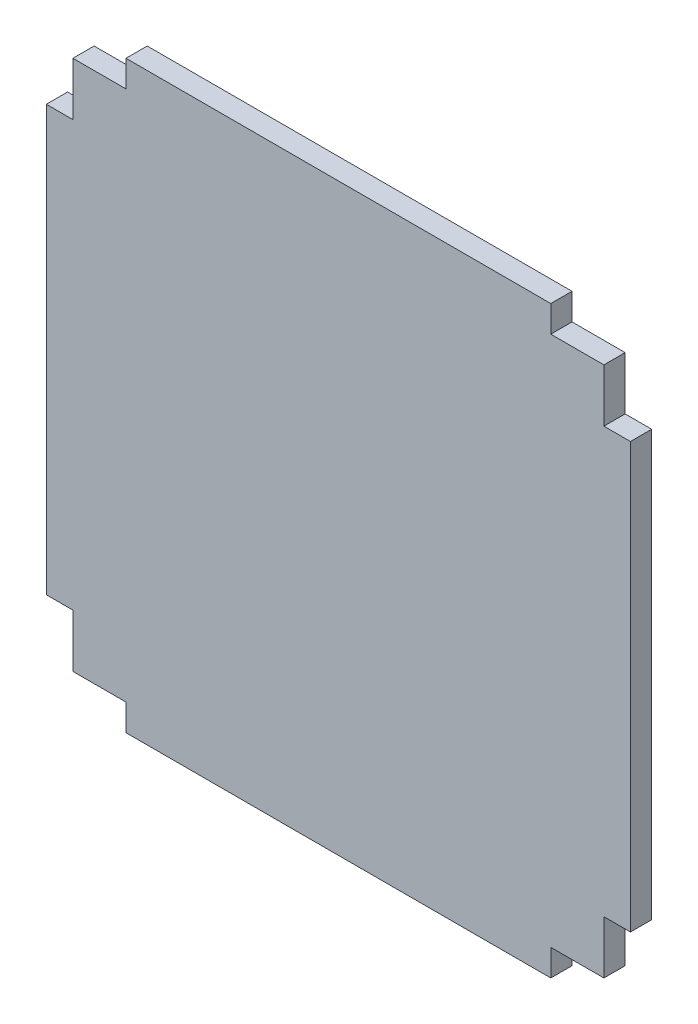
from build123d import *

# Parameters (mm, degrees)
BOSS_EXTRUDE1_DEPTH = 4


with BuildPart() as part:
    # Sketch1 → Boss-Extrude1 (new body)
    with BuildSketch(Plane.XY):
        Polygon((0, 55), (-40, 55), (-40, 50), (-50, 50), (-50, 40), (-55, 40), (-55, -40), (-50, -40), (-50, -50), (-40, -50), (-40, -55), (40, -55), (40, -50), (50, -50), (50, -40), (55, -40), (55, 40), (50, 40), (50, 50), (40, 50), (40, 55), align=None)
    extrude(amount=BOSS_EXTRUDE1_DEPTH)


solid = part.part
